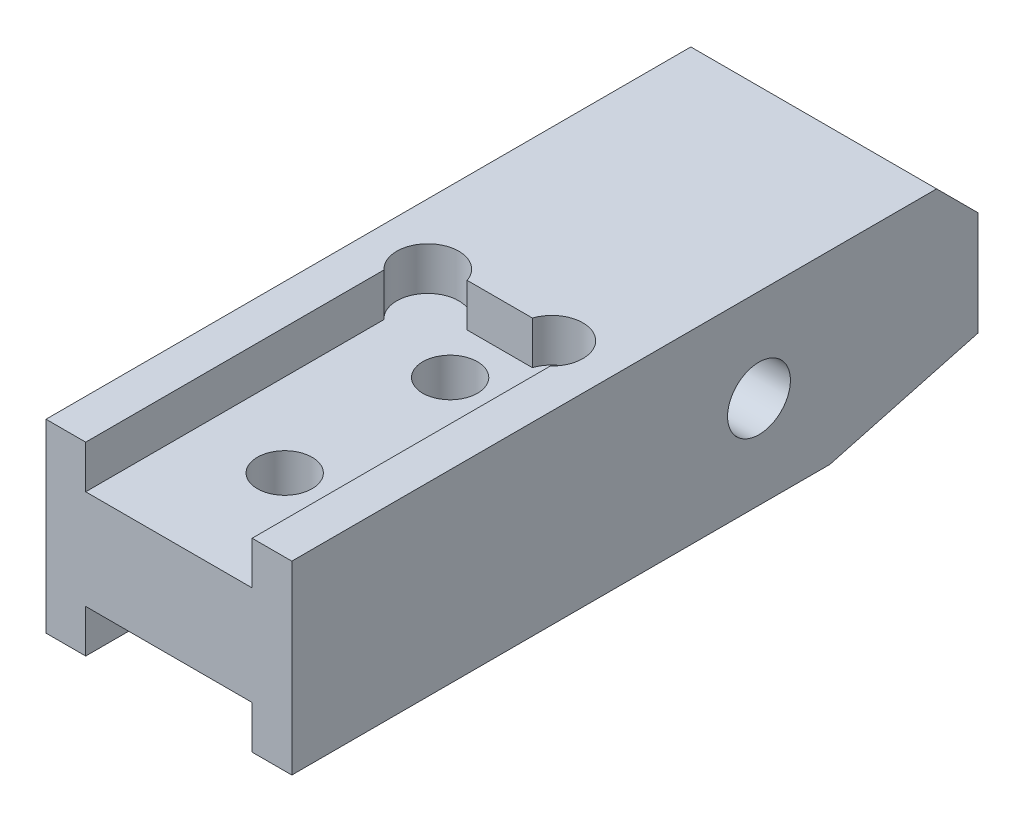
ISO-10303-21;
HEADER;
FILE_DESCRIPTION(('STEP AP214'),'2;1');
FILE_NAME('part.step','',(''),(''),'','','');
FILE_SCHEMA(('AUTOMOTIVE_DESIGN { 1 0 10303 214 1 1 1 1 }'));
ENDSEC;
DATA;
#1=APPLICATION_CONTEXT('core data for automotive mechanical design processes');
#2=APPLICATION_PROTOCOL_DEFINITION('international standard','automotive_design',2000,#1);
#3=PRODUCT_CONTEXT('',#1,'mechanical');
#4=PRODUCT('Part','Part','',(#3));
#5=PRODUCT_RELATED_PRODUCT_CATEGORY('part','',(#4));
#6=PRODUCT_DEFINITION_FORMATION('','',#4);
#7=PRODUCT_DEFINITION_CONTEXT('part definition',#1,'design');
#8=PRODUCT_DEFINITION('design','',#6,#7);
#9=PRODUCT_DEFINITION_SHAPE('','',#8);
#10=(LENGTH_UNIT() NAMED_UNIT(*) SI_UNIT(.MILLI.,.METRE.));
#11=(NAMED_UNIT(*) PLANE_ANGLE_UNIT() SI_UNIT($,.RADIAN.));
#12=(NAMED_UNIT(*) SI_UNIT($,.STERADIAN.) SOLID_ANGLE_UNIT());
#13=UNCERTAINTY_MEASURE_WITH_UNIT(LENGTH_MEASURE(1.E-05),#10,'distance_accuracy_value','');
#14=(GEOMETRIC_REPRESENTATION_CONTEXT(3) GLOBAL_UNCERTAINTY_ASSIGNED_CONTEXT((#13)) GLOBAL_UNIT_ASSIGNED_CONTEXT((#10,
#11,#12)) REPRESENTATION_CONTEXT('',''));
#15=CARTESIAN_POINT('',(0.,0.,0.));
#16=DIRECTION('',(0.,0.,1.));
#17=DIRECTION('',(1.,0.,0.));
#18=AXIS2_PLACEMENT_3D('',#15,#16,#17);
#19=CARTESIAN_POINT('',(-9.43610000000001,7.112,26.3398));
#20=DIRECTION('',(0.,0.,-1.));
#21=DIRECTION('',(-1.,0.,0.));
#22=AXIS2_PLACEMENT_3D('',#19,#20,#21);
#23=PLANE('',#22);
#24=DIRECTION('',(0.,-1.,0.));
#25=VECTOR('',#24,1.);
#26=CARTESIAN_POINT('',(6.3881,-3.81,26.3398));
#27=LINE('',#26,#25);
#28=CARTESIAN_POINT('',(6.3881,-3.81,26.3398));
#29=VERTEX_POINT('',#28);
#30=CARTESIAN_POINT('',(6.3881,-7.112,26.3398));
#31=VERTEX_POINT('',#30);
#32=EDGE_CURVE('E287',#29,#31,#27,.T.);
#33=ORIENTED_EDGE('',*,*,#32,.T.);
#34=DIRECTION('',(1.,0.,0.));
#35=VECTOR('',#34,1.);
#36=CARTESIAN_POINT('',(-9.43610000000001,-7.112,26.3398));
#37=LINE('',#36,#35);
#38=CARTESIAN_POINT('',(9.43610000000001,-7.112,26.3398));
#39=VERTEX_POINT('',#38);
#40=EDGE_CURVE('E190',#31,#39,#37,.T.);
#41=ORIENTED_EDGE('',*,*,#40,.T.);
#42=DIRECTION('',(0.,-1.,0.));
#43=VECTOR('',#42,1.);
#44=CARTESIAN_POINT('',(9.43610000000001,7.112,26.3398));
#45=LINE('',#44,#43);
#46=CARTESIAN_POINT('',(9.43610000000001,7.112,26.3398));
#47=VERTEX_POINT('',#46);
#48=EDGE_CURVE('E183',#47,#39,#45,.T.);
#49=ORIENTED_EDGE('',*,*,#48,.F.);
#50=DIRECTION('',(1.,0.,0.));
#51=VECTOR('',#50,1.);
#52=CARTESIAN_POINT('',(-9.43610000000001,7.112,26.3398));
#53=LINE('',#52,#51);
#54=CARTESIAN_POINT('',(6.3881,7.112,26.3398));
#55=VERTEX_POINT('',#54);
#56=EDGE_CURVE('E187',#55,#47,#53,.T.);
#57=ORIENTED_EDGE('',*,*,#56,.F.);
#58=DIRECTION('',(0.,1.,0.));
#59=VECTOR('',#58,1.);
#60=CARTESIAN_POINT('',(6.3881,3.81,26.3398));
#61=LINE('',#60,#59);
#62=CARTESIAN_POINT('',(6.3881,3.81,26.3398));
#63=VERTEX_POINT('',#62);
#64=EDGE_CURVE('E236',#63,#55,#61,.T.);
#65=ORIENTED_EDGE('',*,*,#64,.F.);
#66=DIRECTION('',(1.,0.,0.));
#67=VECTOR('',#66,1.);
#68=CARTESIAN_POINT('',(6.3881,3.81,26.3398));
#69=LINE('',#68,#67);
#70=CARTESIAN_POINT('',(-6.3881,3.81,26.3398));
#71=VERTEX_POINT('',#70);
#72=EDGE_CURVE('E253',#71,#63,#69,.T.);
#73=ORIENTED_EDGE('',*,*,#72,.F.);
#74=DIRECTION('',(0.,1.,0.));
#75=VECTOR('',#74,1.);
#76=CARTESIAN_POINT('',(-6.3881,3.81,26.3398));
#77=LINE('',#76,#75);
#78=CARTESIAN_POINT('',(-6.3881,7.112,26.3398));
#79=VERTEX_POINT('',#78);
#80=EDGE_CURVE('E231',#71,#79,#77,.T.);
#81=ORIENTED_EDGE('',*,*,#80,.T.);
#82=CARTESIAN_POINT('',(-9.43610000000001,7.112,26.3398));
#83=VERTEX_POINT('',#82);
#84=EDGE_CURVE('E229',#83,#79,#53,.T.);
#85=ORIENTED_EDGE('',*,*,#84,.F.);
#86=DIRECTION('',(0.,-1.,0.));
#87=VECTOR('',#86,1.);
#88=CARTESIAN_POINT('',(-9.43610000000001,7.112,26.3398));
#89=LINE('',#88,#87);
#90=CARTESIAN_POINT('',(-9.43610000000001,-7.112,26.3398));
#91=VERTEX_POINT('',#90);
#92=EDGE_CURVE('E200',#83,#91,#89,.T.);
#93=ORIENTED_EDGE('',*,*,#92,.T.);
#94=CARTESIAN_POINT('',(-6.3881,-7.112,26.3398));
#95=VERTEX_POINT('',#94);
#96=EDGE_CURVE('E185',#91,#95,#37,.T.);
#97=ORIENTED_EDGE('',*,*,#96,.T.);
#98=DIRECTION('',(0.,-1.,0.));
#99=VECTOR('',#98,1.);
#100=CARTESIAN_POINT('',(-6.3881,-3.81,26.3398));
#101=LINE('',#100,#99);
#102=CARTESIAN_POINT('',(-6.3881,-3.81,26.3398));
#103=VERTEX_POINT('',#102);
#104=EDGE_CURVE('E373',#103,#95,#101,.T.);
#105=ORIENTED_EDGE('',*,*,#104,.F.);
#106=DIRECTION('',(1.,0.,0.));
#107=VECTOR('',#106,1.);
#108=CARTESIAN_POINT('',(6.3881,-3.81,26.3398));
#109=LINE('',#108,#107);
#110=EDGE_CURVE('E341',#103,#29,#109,.T.);
#111=ORIENTED_EDGE('',*,*,#110,.T.);
#112=EDGE_LOOP('',(#33,#41,#49,#57,#65,#73,#81,#85,#93,#97,#105,#111));
#113=FACE_BOUND('',#112,.T.);
#114=ADVANCED_FACE('F35',(#113),#23,.F.);
#115=CARTESIAN_POINT('',(-9.43609999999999,-7.112,-26.3398));
#116=DIRECTION('',(0.,1.,0.));
#117=DIRECTION('',(0.,0.,1.));
#118=AXIS2_PLACEMENT_3D('',#115,#116,#117);
#119=PLANE('',#118);
#120=DIRECTION('',(0.,0.,1.));
#121=VECTOR('',#120,1.);
#122=CARTESIAN_POINT('',(-9.43609999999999,-7.112,-26.3398));
#123=LINE('',#122,#121);
#124=CARTESIAN_POINT('',(-9.4361,-7.112,-14.9645091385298));
#125=VERTEX_POINT('',#124);
#126=EDGE_CURVE('E177',#125,#91,#123,.T.);
#127=ORIENTED_EDGE('',*,*,#126,.F.);
#128=DIRECTION('',(-1.,0.,0.));
#129=VECTOR('',#128,1.);
#130=CARTESIAN_POINT('',(9.43610000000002,-7.112,-14.9645091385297));
#131=LINE('',#130,#129);
#132=CARTESIAN_POINT('',(9.43610000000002,-7.112,-14.9645091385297));
#133=VERTEX_POINT('',#132);
#134=EDGE_CURVE('E162',#133,#125,#131,.T.);
#135=ORIENTED_EDGE('',*,*,#134,.F.);
#136=DIRECTION('',(0.,0.,-1.));
#137=VECTOR('',#136,1.);
#138=CARTESIAN_POINT('',(9.43610000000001,-7.112,-26.3398));
#139=LINE('',#138,#137);
#140=EDGE_CURVE('E175',#39,#133,#139,.T.);
#141=ORIENTED_EDGE('',*,*,#140,.F.);
#142=ORIENTED_EDGE('',*,*,#40,.F.);
#143=DIRECTION('',(0.,0.,-1.));
#144=VECTOR('',#143,1.);
#145=CARTESIAN_POINT('',(6.3881,-7.112,26.3398));
#146=LINE('',#145,#144);
#147=CARTESIAN_POINT('',(6.3881,-7.112,3.44185063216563));
#148=VERTEX_POINT('',#147);
#149=EDGE_CURVE('E207',#31,#148,#146,.T.);
#150=ORIENTED_EDGE('',*,*,#149,.T.);
#151=CARTESIAN_POINT('',(4.7625,-7.112,1.7018));
#152=DIRECTION('',(0.,1.,0.));
#153=DIRECTION('',(0.,0.,1.));
#154=AXIS2_PLACEMENT_3D('',#151,#152,#153);
#155=CIRCLE('',#154,2.38125);
#156=CARTESIAN_POINT('',(2.5064619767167,-7.112,0.939799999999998));
#157=VERTEX_POINT('',#156);
#158=EDGE_CURVE('E342',#148,#157,#155,.T.);
#159=ORIENTED_EDGE('',*,*,#158,.T.);
#160=DIRECTION('',(-1.,0.,0.));
#161=VECTOR('',#160,1.);
#162=CARTESIAN_POINT('',(2.5064619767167,-7.112,0.939799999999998));
#163=LINE('',#162,#161);
#164=CARTESIAN_POINT('',(-2.5064619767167,-7.112,0.939799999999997));
#165=VERTEX_POINT('',#164);
#166=EDGE_CURVE('E361',#157,#165,#163,.T.);
#167=ORIENTED_EDGE('',*,*,#166,.T.);
#168=CARTESIAN_POINT('',(-4.7625,-7.112,1.7018));
#169=DIRECTION('',(0.,1.,0.));
#170=DIRECTION('',(0.,0.,1.));
#171=AXIS2_PLACEMENT_3D('',#168,#169,#170);
#172=CIRCLE('',#171,2.38125);
#173=CARTESIAN_POINT('',(-6.38810000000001,-7.112,3.44185063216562));
#174=VERTEX_POINT('',#173);
#175=EDGE_CURVE('E358',#165,#174,#172,.T.);
#176=ORIENTED_EDGE('',*,*,#175,.T.);
#177=DIRECTION('',(0.,0.,1.));
#178=VECTOR('',#177,1.);
#179=CARTESIAN_POINT('',(-6.3881,-7.112,26.3398));
#180=LINE('',#179,#178);
#181=EDGE_CURVE('E355',#174,#95,#180,.T.);
#182=ORIENTED_EDGE('',*,*,#181,.T.);
#183=ORIENTED_EDGE('',*,*,#96,.F.);
#184=EDGE_LOOP('',(#127,#135,#141,#142,#150,#159,#167,#176,#182,#183));
#185=FACE_BOUND('',#184,.T.);
#186=ADVANCED_FACE('F173',(#185),#119,.F.);
#187=CARTESIAN_POINT('',(-9.43609999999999,7.112,-26.3398));
#188=DIRECTION('',(1.,0.,0.));
#189=DIRECTION('',(0.,0.,-1.));
#190=AXIS2_PLACEMENT_3D('',#187,#188,#189);
#191=PLANE('',#190);
#192=CARTESIAN_POINT('',(-9.4361,0.,-9.525));
#193=DIRECTION('',(-1.,0.,0.));
#194=DIRECTION('',(0.,0.,1.));
#195=AXIS2_PLACEMENT_3D('',#192,#193,#194);
#196=CIRCLE('',#195,2.413);
#197=CARTESIAN_POINT('',(-9.4361,0.,-7.112));
#198=VERTEX_POINT('',#197);
#199=EDGE_CURVE('E326',#198,#198,#196,.T.);
#200=ORIENTED_EDGE('',*,*,#199,.F.);
#201=EDGE_LOOP('',(#200));
#202=FACE_BOUND('',#201,.T.);
#203=DIRECTION('',(0.,0.,1.));
#204=VECTOR('',#203,1.);
#205=CARTESIAN_POINT('',(-9.43609999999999,7.112,-26.3398));
#206=LINE('',#205,#204);
#207=CARTESIAN_POINT('',(-9.43609999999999,7.112,-23.1648));
#208=VERTEX_POINT('',#207);
#209=EDGE_CURVE('E184',#208,#83,#206,.T.);
#210=ORIENTED_EDGE('',*,*,#209,.F.);
#211=DIRECTION('',(0.,-0.707106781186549,-0.707106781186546));
#212=VECTOR('',#211,1.);
#213=CARTESIAN_POINT('',(-9.43609999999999,7.112,-23.1648));
#214=LINE('',#213,#212);
#215=CARTESIAN_POINT('',(-9.43609999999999,3.93699999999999,-26.3398));
#216=VERTEX_POINT('',#215);
#217=EDGE_CURVE('E57',#208,#216,#214,.T.);
#218=ORIENTED_EDGE('',*,*,#217,.T.);
#219=DIRECTION('',(0.,-1.,0.));
#220=VECTOR('',#219,1.);
#221=CARTESIAN_POINT('',(-9.43609999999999,7.112,-26.3398));
#222=LINE('',#221,#220);
#223=CARTESIAN_POINT('',(-9.43609999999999,-4.064,-26.3398));
#224=VERTEX_POINT('',#223);
#225=EDGE_CURVE('E194',#216,#224,#222,.T.);
#226=ORIENTED_EDGE('',*,*,#225,.T.);
#227=DIRECTION('',(0.,0.258819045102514,-0.96592582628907));
#228=VECTOR('',#227,1.);
#229=CARTESIAN_POINT('',(-9.4361,-7.112,-14.9645091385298));
#230=LINE('',#229,#228);
#231=EDGE_CURVE('E168',#125,#224,#230,.T.);
#232=ORIENTED_EDGE('',*,*,#231,.F.);
#233=ORIENTED_EDGE('',*,*,#126,.T.);
#234=ORIENTED_EDGE('',*,*,#92,.F.);
#235=EDGE_LOOP('',(#210,#218,#226,#232,#233,#234));
#236=FACE_BOUND('',#235,.T.);
#237=ADVANCED_FACE('F224',(#202,#236),#191,.F.);
#238=CARTESIAN_POINT('',(9.43610000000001,7.112,-26.3398));
#239=DIRECTION('',(-1.,0.,0.));
#240=DIRECTION('',(0.,0.,1.));
#241=AXIS2_PLACEMENT_3D('',#238,#239,#240);
#242=PLANE('',#241);
#243=CARTESIAN_POINT('',(9.43610000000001,0.,-9.52499999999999));
#244=DIRECTION('',(-1.,0.,0.));
#245=DIRECTION('',(0.,0.,1.));
#246=AXIS2_PLACEMENT_3D('',#243,#244,#245);
#247=CIRCLE('',#246,2.413);
#248=CARTESIAN_POINT('',(9.43610000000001,0.,-7.11199999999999));
#249=VERTEX_POINT('',#248);
#250=EDGE_CURVE('E328',#249,#249,#247,.T.);
#251=ORIENTED_EDGE('',*,*,#250,.T.);
#252=EDGE_LOOP('',(#251));
#253=FACE_BOUND('',#252,.T.);
#254=DIRECTION('',(0.,-1.,0.));
#255=VECTOR('',#254,1.);
#256=CARTESIAN_POINT('',(9.43610000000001,7.112,-26.3398));
#257=LINE('',#256,#255);
#258=CARTESIAN_POINT('',(9.43610000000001,3.93699999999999,-26.3398));
#259=VERTEX_POINT('',#258);
#260=CARTESIAN_POINT('',(9.43610000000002,-4.064,-26.3398));
#261=VERTEX_POINT('',#260);
#262=EDGE_CURVE('E196',#259,#261,#257,.T.);
#263=ORIENTED_EDGE('',*,*,#262,.F.);
#264=DIRECTION('',(0.,0.707106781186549,0.707106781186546));
#265=VECTOR('',#264,1.);
#266=CARTESIAN_POINT('',(9.43610000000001,7.112,-23.1648));
#267=LINE('',#266,#265);
#268=CARTESIAN_POINT('',(9.43610000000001,7.112,-23.1648));
#269=VERTEX_POINT('',#268);
#270=EDGE_CURVE('E11',#259,#269,#267,.T.);
#271=ORIENTED_EDGE('',*,*,#270,.T.);
#272=DIRECTION('',(0.,0.,-1.));
#273=VECTOR('',#272,1.);
#274=CARTESIAN_POINT('',(9.43610000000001,7.112,-26.3398));
#275=LINE('',#274,#273);
#276=EDGE_CURVE('E197',#47,#269,#275,.T.);
#277=ORIENTED_EDGE('',*,*,#276,.F.);
#278=ORIENTED_EDGE('',*,*,#48,.T.);
#279=ORIENTED_EDGE('',*,*,#140,.T.);
#280=DIRECTION('',(0.,0.258819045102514,-0.96592582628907));
#281=VECTOR('',#280,1.);
#282=CARTESIAN_POINT('',(9.43610000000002,-7.112,-14.9645091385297));
#283=LINE('',#282,#281);
#284=EDGE_CURVE('E158',#133,#261,#283,.T.);
#285=ORIENTED_EDGE('',*,*,#284,.T.);
#286=EDGE_LOOP('',(#263,#271,#277,#278,#279,#285));
#287=FACE_BOUND('',#286,.T.);
#288=ADVANCED_FACE('F180',(#253,#287),#242,.F.);
#289=CARTESIAN_POINT('',(-9.43609999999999,7.112,-26.3398));
#290=DIRECTION('',(0.,0.,1.));
#291=DIRECTION('',(1.,0.,0.));
#292=AXIS2_PLACEMENT_3D('',#289,#290,#291);
#293=PLANE('',#292);
#294=ORIENTED_EDGE('',*,*,#225,.F.);
#295=DIRECTION('',(1.,0.,0.));
#296=VECTOR('',#295,1.);
#297=CARTESIAN_POINT('',(9.43610000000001,3.93699999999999,-26.3398));
#298=LINE('',#297,#296);
#299=EDGE_CURVE('E43',#216,#259,#298,.T.);
#300=ORIENTED_EDGE('',*,*,#299,.T.);
#301=ORIENTED_EDGE('',*,*,#262,.T.);
#302=DIRECTION('',(-1.,0.,0.));
#303=VECTOR('',#302,1.);
#304=CARTESIAN_POINT('',(9.43610000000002,-4.064,-26.3398));
#305=LINE('',#304,#303);
#306=EDGE_CURVE('E165',#261,#224,#305,.T.);
#307=ORIENTED_EDGE('',*,*,#306,.T.);
#308=EDGE_LOOP('',(#294,#300,#301,#307));
#309=FACE_BOUND('',#308,.T.);
#310=ADVANCED_FACE('F322',(#309),#293,.F.);
#311=CARTESIAN_POINT('',(-9.43609999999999,7.112,-26.3398));
#312=DIRECTION('',(0.,1.,0.));
#313=DIRECTION('',(0.,0.,1.));
#314=AXIS2_PLACEMENT_3D('',#311,#312,#313);
#315=PLANE('',#314);
#316=ORIENTED_EDGE('',*,*,#276,.T.);
#317=DIRECTION('',(-1.,0.,0.));
#318=VECTOR('',#317,1.);
#319=CARTESIAN_POINT('',(-9.43609999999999,7.112,-23.1648));
#320=LINE('',#319,#318);
#321=EDGE_CURVE('E203',#269,#208,#320,.T.);
#322=ORIENTED_EDGE('',*,*,#321,.T.);
#323=ORIENTED_EDGE('',*,*,#209,.T.);
#324=ORIENTED_EDGE('',*,*,#84,.T.);
#325=DIRECTION('',(0.,0.,1.));
#326=VECTOR('',#325,1.);
#327=CARTESIAN_POINT('',(-6.3881,7.112,26.3398));
#328=LINE('',#327,#326);
#329=CARTESIAN_POINT('',(-6.38810000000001,7.112,3.44185063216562));
#330=VERTEX_POINT('',#329);
#331=EDGE_CURVE('E244',#330,#79,#328,.T.);
#332=ORIENTED_EDGE('',*,*,#331,.F.);
#333=CARTESIAN_POINT('',(-4.7625,7.112,1.7018));
#334=DIRECTION('',(0.,1.,0.));
#335=DIRECTION('',(0.,0.,1.));
#336=AXIS2_PLACEMENT_3D('',#333,#334,#335);
#337=CIRCLE('',#336,2.38125);
#338=CARTESIAN_POINT('',(-2.5064619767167,7.112,0.939799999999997));
#339=VERTEX_POINT('',#338);
#340=EDGE_CURVE('E275',#339,#330,#337,.T.);
#341=ORIENTED_EDGE('',*,*,#340,.F.);
#342=DIRECTION('',(-1.,0.,0.));
#343=VECTOR('',#342,1.);
#344=CARTESIAN_POINT('',(2.5064619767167,7.112,0.939799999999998));
#345=LINE('',#344,#343);
#346=CARTESIAN_POINT('',(2.5064619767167,7.112,0.939799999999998));
#347=VERTEX_POINT('',#346);
#348=EDGE_CURVE('E273',#347,#339,#345,.T.);
#349=ORIENTED_EDGE('',*,*,#348,.F.);
#350=CARTESIAN_POINT('',(4.7625,7.112,1.7018));
#351=DIRECTION('',(0.,1.,0.));
#352=DIRECTION('',(0.,0.,1.));
#353=AXIS2_PLACEMENT_3D('',#350,#351,#352);
#354=CIRCLE('',#353,2.38125);
#355=CARTESIAN_POINT('',(6.3881,7.112,3.44185063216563));
#356=VERTEX_POINT('',#355);
#357=EDGE_CURVE('E270',#356,#347,#354,.T.);
#358=ORIENTED_EDGE('',*,*,#357,.F.);
#359=DIRECTION('',(0.,0.,-1.));
#360=VECTOR('',#359,1.);
#361=CARTESIAN_POINT('',(6.3881,7.112,26.3398));
#362=LINE('',#361,#360);
#363=EDGE_CURVE('E268',#55,#356,#362,.T.);
#364=ORIENTED_EDGE('',*,*,#363,.F.);
#365=ORIENTED_EDGE('',*,*,#56,.T.);
#366=EDGE_LOOP('',(#316,#322,#323,#324,#332,#341,#349,#358,#364,#365));
#367=FACE_BOUND('',#366,.T.);
#368=ADVANCED_FACE('F218',(#367),#315,.T.);
#369=CARTESIAN_POINT('',(6.3881,3.81,26.3398));
#370=DIRECTION('',(1.,0.,0.));
#371=DIRECTION('',(0.,0.,-1.));
#372=AXIS2_PLACEMENT_3D('',#369,#370,#371);
#373=PLANE('',#372);
#374=ORIENTED_EDGE('',*,*,#363,.T.);
#375=DIRECTION('',(0.,1.,0.));
#376=VECTOR('',#375,1.);
#377=CARTESIAN_POINT('',(6.3881,3.81,3.44185063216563));
#378=LINE('',#377,#376);
#379=CARTESIAN_POINT('',(6.3881,3.81,3.44185063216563));
#380=VERTEX_POINT('',#379);
#381=EDGE_CURVE('E251',#380,#356,#378,.T.);
#382=ORIENTED_EDGE('',*,*,#381,.F.);
#383=DIRECTION('',(0.,0.,-1.));
#384=VECTOR('',#383,1.);
#385=CARTESIAN_POINT('',(6.3881,3.81,26.3398));
#386=LINE('',#385,#384);
#387=EDGE_CURVE('E279',#63,#380,#386,.T.);
#388=ORIENTED_EDGE('',*,*,#387,.F.);
#389=ORIENTED_EDGE('',*,*,#64,.T.);
#390=EDGE_LOOP('',(#374,#382,#388,#389));
#391=FACE_BOUND('',#390,.T.);
#392=ADVANCED_FACE('F299',(#391),#373,.F.);
#393=CARTESIAN_POINT('',(-6.3881,3.81,26.3398));
#394=DIRECTION('',(-1.,0.,0.));
#395=DIRECTION('',(0.,0.,1.));
#396=AXIS2_PLACEMENT_3D('',#393,#394,#395);
#397=PLANE('',#396);
#398=ORIENTED_EDGE('',*,*,#331,.T.);
#399=ORIENTED_EDGE('',*,*,#80,.F.);
#400=DIRECTION('',(0.,0.,1.));
#401=VECTOR('',#400,1.);
#402=CARTESIAN_POINT('',(-6.3881,3.81,26.3398));
#403=LINE('',#402,#401);
#404=CARTESIAN_POINT('',(-6.38810000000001,3.81,3.44185063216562));
#405=VERTEX_POINT('',#404);
#406=EDGE_CURVE('E259',#405,#71,#403,.T.);
#407=ORIENTED_EDGE('',*,*,#406,.F.);
#408=DIRECTION('',(0.,1.,0.));
#409=VECTOR('',#408,1.);
#410=CARTESIAN_POINT('',(-6.38810000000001,3.81,3.44185063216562));
#411=LINE('',#410,#409);
#412=EDGE_CURVE('E241',#405,#330,#411,.T.);
#413=ORIENTED_EDGE('',*,*,#412,.T.);
#414=EDGE_LOOP('',(#398,#399,#407,#413));
#415=FACE_BOUND('',#414,.T.);
#416=ADVANCED_FACE('F297',(#415),#397,.F.);
#417=CARTESIAN_POINT('',(-4.7625,3.81,1.7018));
#418=DIRECTION('',(0.,1.,0.));
#419=DIRECTION('',(0.,0.,1.));
#420=AXIS2_PLACEMENT_3D('',#417,#418,#419);
#421=CYLINDRICAL_SURFACE('',#420,2.38125);
#422=ORIENTED_EDGE('',*,*,#340,.T.);
#423=ORIENTED_EDGE('',*,*,#412,.F.);
#424=CARTESIAN_POINT('',(-4.7625,3.81,1.7018));
#425=DIRECTION('',(0.,1.,0.));
#426=DIRECTION('',(0.,0.,1.));
#427=AXIS2_PLACEMENT_3D('',#424,#425,#426);
#428=CIRCLE('',#427,2.38125);
#429=CARTESIAN_POINT('',(-2.5064619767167,3.81,0.939799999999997));
#430=VERTEX_POINT('',#429);
#431=EDGE_CURVE('E264',#430,#405,#428,.T.);
#432=ORIENTED_EDGE('',*,*,#431,.F.);
#433=DIRECTION('',(0.,1.,0.));
#434=VECTOR('',#433,1.);
#435=CARTESIAN_POINT('',(-2.5064619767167,3.81,0.939799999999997));
#436=LINE('',#435,#434);
#437=EDGE_CURVE('E248',#430,#339,#436,.T.);
#438=ORIENTED_EDGE('',*,*,#437,.T.);
#439=EDGE_LOOP('',(#422,#423,#432,#438));
#440=FACE_BOUND('',#439,.T.);
#441=ADVANCED_FACE('F296',(#440),#421,.F.);
#442=CARTESIAN_POINT('',(2.5064619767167,3.81,0.939799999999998));
#443=DIRECTION('',(0.,0.,-1.));
#444=DIRECTION('',(-1.,0.,0.));
#445=AXIS2_PLACEMENT_3D('',#442,#443,#444);
#446=PLANE('',#445);
#447=ORIENTED_EDGE('',*,*,#348,.T.);
#448=ORIENTED_EDGE('',*,*,#437,.F.);
#449=DIRECTION('',(-1.,0.,0.));
#450=VECTOR('',#449,1.);
#451=CARTESIAN_POINT('',(2.5064619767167,3.81,0.939799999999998));
#452=LINE('',#451,#450);
#453=CARTESIAN_POINT('',(2.5064619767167,3.81,0.939799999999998));
#454=VERTEX_POINT('',#453);
#455=EDGE_CURVE('E284',#454,#430,#452,.T.);
#456=ORIENTED_EDGE('',*,*,#455,.F.);
#457=DIRECTION('',(0.,1.,0.));
#458=VECTOR('',#457,1.);
#459=CARTESIAN_POINT('',(2.5064619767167,3.81,0.939799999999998));
#460=LINE('',#459,#458);
#461=EDGE_CURVE('E250',#454,#347,#460,.T.);
#462=ORIENTED_EDGE('',*,*,#461,.T.);
#463=EDGE_LOOP('',(#447,#448,#456,#462));
#464=FACE_BOUND('',#463,.T.);
#465=ADVANCED_FACE('F305',(#464),#446,.F.);
#466=CARTESIAN_POINT('',(4.7625,3.81,1.7018));
#467=DIRECTION('',(0.,1.,0.));
#468=DIRECTION('',(0.,0.,1.));
#469=AXIS2_PLACEMENT_3D('',#466,#467,#468);
#470=CYLINDRICAL_SURFACE('',#469,2.38125);
#471=ORIENTED_EDGE('',*,*,#357,.T.);
#472=ORIENTED_EDGE('',*,*,#461,.F.);
#473=CARTESIAN_POINT('',(4.7625,3.81,1.7018));
#474=DIRECTION('',(0.,1.,0.));
#475=DIRECTION('',(0.,0.,1.));
#476=AXIS2_PLACEMENT_3D('',#473,#474,#475);
#477=CIRCLE('',#476,2.38125);
#478=EDGE_CURVE('E281',#380,#454,#477,.T.);
#479=ORIENTED_EDGE('',*,*,#478,.F.);
#480=ORIENTED_EDGE('',*,*,#381,.T.);
#481=EDGE_LOOP('',(#471,#472,#479,#480));
#482=FACE_BOUND('',#481,.T.);
#483=ADVANCED_FACE('F411',(#482),#470,.F.);
#484=CARTESIAN_POINT('',(4.7625,3.81,1.7018));
#485=DIRECTION('',(0.,1.,0.));
#486=DIRECTION('',(0.,0.,1.));
#487=AXIS2_PLACEMENT_3D('',#484,#485,#486);
#488=PLANE('',#487);
#489=CARTESIAN_POINT('',(0.,3.81,4.7498));
#490=DIRECTION('',(0.,1.,0.));
#491=DIRECTION('',(0.,0.,1.));
#492=AXIS2_PLACEMENT_3D('',#489,#490,#491);
#493=CIRCLE('',#492,2.1);
#494=CARTESIAN_POINT('',(0.,3.81,6.8498));
#495=VERTEX_POINT('',#494);
#496=EDGE_CURVE('E212',#495,#495,#493,.T.);
#497=ORIENTED_EDGE('',*,*,#496,.F.);
#498=EDGE_LOOP('',(#497));
#499=FACE_BOUND('',#498,.T.);
#500=CARTESIAN_POINT('',(0.,3.81,17.4498));
#501=DIRECTION('',(0.,1.,0.));
#502=DIRECTION('',(0.,0.,1.));
#503=AXIS2_PLACEMENT_3D('',#500,#501,#502);
#504=CIRCLE('',#503,2.1);
#505=CARTESIAN_POINT('',(0.,3.81,19.5498));
#506=VERTEX_POINT('',#505);
#507=EDGE_CURVE('E208',#506,#506,#504,.T.);
#508=ORIENTED_EDGE('',*,*,#507,.F.);
#509=EDGE_LOOP('',(#508));
#510=FACE_BOUND('',#509,.T.);
#511=ORIENTED_EDGE('',*,*,#387,.T.);
#512=ORIENTED_EDGE('',*,*,#478,.T.);
#513=ORIENTED_EDGE('',*,*,#455,.T.);
#514=ORIENTED_EDGE('',*,*,#431,.T.);
#515=ORIENTED_EDGE('',*,*,#406,.T.);
#516=ORIENTED_EDGE('',*,*,#72,.T.);
#517=EDGE_LOOP('',(#511,#512,#513,#514,#515,#516));
#518=FACE_BOUND('',#517,.T.);
#519=ADVANCED_FACE('F293',(#499,#510,#518),#488,.T.);
#520=CARTESIAN_POINT('',(6.3881,-3.81,26.3398));
#521=DIRECTION('',(-1.,0.,0.));
#522=DIRECTION('',(0.,0.,1.));
#523=AXIS2_PLACEMENT_3D('',#520,#521,#522);
#524=PLANE('',#523);
#525=ORIENTED_EDGE('',*,*,#149,.F.);
#526=ORIENTED_EDGE('',*,*,#32,.F.);
#527=DIRECTION('',(0.,0.,-1.));
#528=VECTOR('',#527,1.);
#529=CARTESIAN_POINT('',(6.3881,-3.81,26.3398));
#530=LINE('',#529,#528);
#531=CARTESIAN_POINT('',(6.3881,-3.81,3.44185063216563));
#532=VERTEX_POINT('',#531);
#533=EDGE_CURVE('E338',#29,#532,#530,.T.);
#534=ORIENTED_EDGE('',*,*,#533,.T.);
#535=DIRECTION('',(0.,-1.,0.));
#536=VECTOR('',#535,1.);
#537=CARTESIAN_POINT('',(6.3881,-3.81,3.44185063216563));
#538=LINE('',#537,#536);
#539=EDGE_CURVE('E271',#532,#148,#538,.T.);
#540=ORIENTED_EDGE('',*,*,#539,.T.);
#541=EDGE_LOOP('',(#525,#526,#534,#540));
#542=FACE_BOUND('',#541,.T.);
#543=ADVANCED_FACE('F379',(#542),#524,.T.);
#544=CARTESIAN_POINT('',(4.7625,-3.81,1.7018));
#545=DIRECTION('',(0.,-1.,0.));
#546=DIRECTION('',(0.,0.,-1.));
#547=AXIS2_PLACEMENT_3D('',#544,#545,#546);
#548=CYLINDRICAL_SURFACE('',#547,2.38125);
#549=ORIENTED_EDGE('',*,*,#158,.F.);
#550=ORIENTED_EDGE('',*,*,#539,.F.);
#551=CARTESIAN_POINT('',(4.7625,-3.81,1.7018));
#552=DIRECTION('',(0.,1.,0.));
#553=DIRECTION('',(0.,0.,1.));
#554=AXIS2_PLACEMENT_3D('',#551,#552,#553);
#555=CIRCLE('',#554,2.38125);
#556=CARTESIAN_POINT('',(2.5064619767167,-3.81,0.939799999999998));
#557=VERTEX_POINT('',#556);
#558=EDGE_CURVE('E351',#532,#557,#555,.T.);
#559=ORIENTED_EDGE('',*,*,#558,.T.);
#560=DIRECTION('',(0.,-1.,0.));
#561=VECTOR('',#560,1.);
#562=CARTESIAN_POINT('',(2.5064619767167,-3.81,0.939799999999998));
#563=LINE('',#562,#561);
#564=EDGE_CURVE('E368',#557,#157,#563,.T.);
#565=ORIENTED_EDGE('',*,*,#564,.T.);
#566=EDGE_LOOP('',(#549,#550,#559,#565));
#567=FACE_BOUND('',#566,.T.);
#568=ADVANCED_FACE('F382',(#567),#548,.F.);
#569=CARTESIAN_POINT('',(2.5064619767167,-3.81,0.939799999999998));
#570=DIRECTION('',(0.,0.,1.));
#571=DIRECTION('',(1.,0.,0.));
#572=AXIS2_PLACEMENT_3D('',#569,#570,#571);
#573=PLANE('',#572);
#574=ORIENTED_EDGE('',*,*,#166,.F.);
#575=ORIENTED_EDGE('',*,*,#564,.F.);
#576=DIRECTION('',(-1.,0.,0.));
#577=VECTOR('',#576,1.);
#578=CARTESIAN_POINT('',(2.5064619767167,-3.81,0.939799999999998));
#579=LINE('',#578,#577);
#580=CARTESIAN_POINT('',(-2.5064619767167,-3.81,0.939799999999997));
#581=VERTEX_POINT('',#580);
#582=EDGE_CURVE('E349',#557,#581,#579,.T.);
#583=ORIENTED_EDGE('',*,*,#582,.T.);
#584=DIRECTION('',(0.,-1.,0.));
#585=VECTOR('',#584,1.);
#586=CARTESIAN_POINT('',(-2.5064619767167,-3.81,0.939799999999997));
#587=LINE('',#586,#585);
#588=EDGE_CURVE('E370',#581,#165,#587,.T.);
#589=ORIENTED_EDGE('',*,*,#588,.T.);
#590=EDGE_LOOP('',(#574,#575,#583,#589));
#591=FACE_BOUND('',#590,.T.);
#592=ADVANCED_FACE('F387',(#591),#573,.T.);
#593=CARTESIAN_POINT('',(-4.7625,-3.81,1.7018));
#594=DIRECTION('',(0.,-1.,0.));
#595=DIRECTION('',(0.,0.,-1.));
#596=AXIS2_PLACEMENT_3D('',#593,#594,#595);
#597=CYLINDRICAL_SURFACE('',#596,2.38125);
#598=ORIENTED_EDGE('',*,*,#175,.F.);
#599=ORIENTED_EDGE('',*,*,#588,.F.);
#600=CARTESIAN_POINT('',(-4.7625,-3.81,1.7018));
#601=DIRECTION('',(0.,1.,0.));
#602=DIRECTION('',(0.,0.,1.));
#603=AXIS2_PLACEMENT_3D('',#600,#601,#602);
#604=CIRCLE('',#603,2.38125);
#605=CARTESIAN_POINT('',(-6.38810000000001,-3.81,3.44185063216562));
#606=VERTEX_POINT('',#605);
#607=EDGE_CURVE('E347',#581,#606,#604,.T.);
#608=ORIENTED_EDGE('',*,*,#607,.T.);
#609=DIRECTION('',(0.,-1.,0.));
#610=VECTOR('',#609,1.);
#611=CARTESIAN_POINT('',(-6.38810000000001,-3.81,3.44185063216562));
#612=LINE('',#611,#610);
#613=EDGE_CURVE('E372',#606,#174,#612,.T.);
#614=ORIENTED_EDGE('',*,*,#613,.T.);
#615=EDGE_LOOP('',(#598,#599,#608,#614));
#616=FACE_BOUND('',#615,.T.);
#617=ADVANCED_FACE('F391',(#616),#597,.F.);
#618=CARTESIAN_POINT('',(-6.3881,-3.81,26.3398));
#619=DIRECTION('',(1.,0.,0.));
#620=DIRECTION('',(0.,0.,-1.));
#621=AXIS2_PLACEMENT_3D('',#618,#619,#620);
#622=PLANE('',#621);
#623=ORIENTED_EDGE('',*,*,#181,.F.);
#624=ORIENTED_EDGE('',*,*,#613,.F.);
#625=DIRECTION('',(0.,0.,1.));
#626=VECTOR('',#625,1.);
#627=CARTESIAN_POINT('',(-6.3881,-3.81,26.3398));
#628=LINE('',#627,#626);
#629=EDGE_CURVE('E345',#606,#103,#628,.T.);
#630=ORIENTED_EDGE('',*,*,#629,.T.);
#631=ORIENTED_EDGE('',*,*,#104,.T.);
#632=EDGE_LOOP('',(#623,#624,#630,#631));
#633=FACE_BOUND('',#632,.T.);
#634=ADVANCED_FACE('F395',(#633),#622,.T.);
#635=CARTESIAN_POINT('',(4.7625,-3.81,1.7018));
#636=DIRECTION('',(0.,-1.,0.));
#637=DIRECTION('',(0.,0.,1.));
#638=AXIS2_PLACEMENT_3D('',#635,#636,#637);
#639=PLANE('',#638);
#640=CARTESIAN_POINT('',(0.,-3.81,4.7498));
#641=DIRECTION('',(0.,-1.,0.));
#642=DIRECTION('',(0.,0.,-1.));
#643=AXIS2_PLACEMENT_3D('',#640,#641,#642);
#644=CIRCLE('',#643,2.1);
#645=CARTESIAN_POINT('',(0.,-3.81,2.6498));
#646=VERTEX_POINT('',#645);
#647=EDGE_CURVE('E209',#646,#646,#644,.T.);
#648=ORIENTED_EDGE('',*,*,#647,.F.);
#649=EDGE_LOOP('',(#648));
#650=FACE_BOUND('',#649,.T.);
#651=CARTESIAN_POINT('',(0.,-3.81,17.4498));
#652=DIRECTION('',(0.,-1.,0.));
#653=DIRECTION('',(0.,0.,-1.));
#654=AXIS2_PLACEMENT_3D('',#651,#652,#653);
#655=CIRCLE('',#654,2.1);
#656=CARTESIAN_POINT('',(0.,-3.81,15.3498));
#657=VERTEX_POINT('',#656);
#658=EDGE_CURVE('E204',#657,#657,#655,.T.);
#659=ORIENTED_EDGE('',*,*,#658,.F.);
#660=EDGE_LOOP('',(#659));
#661=FACE_BOUND('',#660,.T.);
#662=ORIENTED_EDGE('',*,*,#533,.F.);
#663=ORIENTED_EDGE('',*,*,#110,.F.);
#664=ORIENTED_EDGE('',*,*,#629,.F.);
#665=ORIENTED_EDGE('',*,*,#607,.F.);
#666=ORIENTED_EDGE('',*,*,#582,.F.);
#667=ORIENTED_EDGE('',*,*,#558,.F.);
#668=EDGE_LOOP('',(#662,#663,#664,#665,#666,#667));
#669=FACE_BOUND('',#668,.T.);
#670=ADVANCED_FACE('F397',(#650,#661,#669),#639,.T.);
#671=CARTESIAN_POINT('',(0.,3.81,17.4498));
#672=DIRECTION('',(0.,1.,0.));
#673=DIRECTION('',(0.,0.,1.));
#674=AXIS2_PLACEMENT_3D('',#671,#672,#673);
#675=CYLINDRICAL_SURFACE('',#674,2.1);
#676=ORIENTED_EDGE('',*,*,#658,.T.);
#677=EDGE_LOOP('',(#676));
#678=FACE_BOUND('',#677,.T.);
#679=ORIENTED_EDGE('',*,*,#507,.T.);
#680=EDGE_LOOP('',(#679));
#681=FACE_BOUND('',#680,.T.);
#682=ADVANCED_FACE('F403',(#678,#681),#675,.F.);
#683=CARTESIAN_POINT('',(0.,3.81,4.7498));
#684=DIRECTION('',(0.,1.,0.));
#685=DIRECTION('',(0.,0.,1.));
#686=AXIS2_PLACEMENT_3D('',#683,#684,#685);
#687=CYLINDRICAL_SURFACE('',#686,2.1);
#688=ORIENTED_EDGE('',*,*,#647,.T.);
#689=EDGE_LOOP('',(#688));
#690=FACE_BOUND('',#689,.T.);
#691=ORIENTED_EDGE('',*,*,#496,.T.);
#692=EDGE_LOOP('',(#691));
#693=FACE_BOUND('',#692,.T.);
#694=ADVANCED_FACE('F422',(#690,#693),#687,.F.);
#695=CARTESIAN_POINT('',(9.43610000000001,0.,-9.52499999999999));
#696=DIRECTION('',(-1.,0.,0.));
#697=DIRECTION('',(0.,0.,1.));
#698=AXIS2_PLACEMENT_3D('',#695,#696,#697);
#699=CYLINDRICAL_SURFACE('',#698,2.413);
#700=ORIENTED_EDGE('',*,*,#250,.F.);
#701=EDGE_LOOP('',(#700));
#702=FACE_BOUND('',#701,.T.);
#703=ORIENTED_EDGE('',*,*,#199,.T.);
#704=EDGE_LOOP('',(#703));
#705=FACE_BOUND('',#704,.T.);
#706=ADVANCED_FACE('F428',(#702,#705),#699,.F.);
#707=CARTESIAN_POINT('',(9.43610000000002,-7.112,-14.9645091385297));
#708=DIRECTION('',(0.,0.96592582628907,0.258819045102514));
#709=DIRECTION('',(0.,-0.258819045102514,0.96592582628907));
#710=AXIS2_PLACEMENT_3D('',#707,#708,#709);
#711=PLANE('',#710);
#712=ORIENTED_EDGE('',*,*,#231,.T.);
#713=ORIENTED_EDGE('',*,*,#306,.F.);
#714=ORIENTED_EDGE('',*,*,#284,.F.);
#715=ORIENTED_EDGE('',*,*,#134,.T.);
#716=EDGE_LOOP('',(#712,#713,#714,#715));
#717=FACE_BOUND('',#716,.T.);
#718=ADVANCED_FACE('F161',(#717),#711,.F.);
#719=CARTESIAN_POINT('',(-9.43609999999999,7.112,-23.1648));
#720=DIRECTION('',(0.,0.707106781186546,-0.707106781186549));
#721=DIRECTION('',(0.,0.707106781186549,0.707106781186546));
#722=AXIS2_PLACEMENT_3D('',#719,#720,#721);
#723=PLANE('',#722);
#724=ORIENTED_EDGE('',*,*,#270,.F.);
#725=ORIENTED_EDGE('',*,*,#299,.F.);
#726=ORIENTED_EDGE('',*,*,#217,.F.);
#727=ORIENTED_EDGE('',*,*,#321,.F.);
#728=EDGE_LOOP('',(#724,#725,#726,#727));
#729=FACE_BOUND('',#728,.T.);
#730=ADVANCED_FACE('F37',(#729),#723,.T.);
#731=CLOSED_SHELL('',(#114,#186,#237,#288,#310,#368,#392,#416,#441,#465,#483,#519,#543,#568,
#592,#617,#634,#670,#682,#694,#706,#718,#730));
#732=MANIFOLD_SOLID_BREP('B2',#731);
#733=ADVANCED_BREP_SHAPE_REPRESENTATION('',(#18,#732),#14);
#734=SHAPE_DEFINITION_REPRESENTATION(#9,#733);
ENDSEC;
END-ISO-10303-21;
